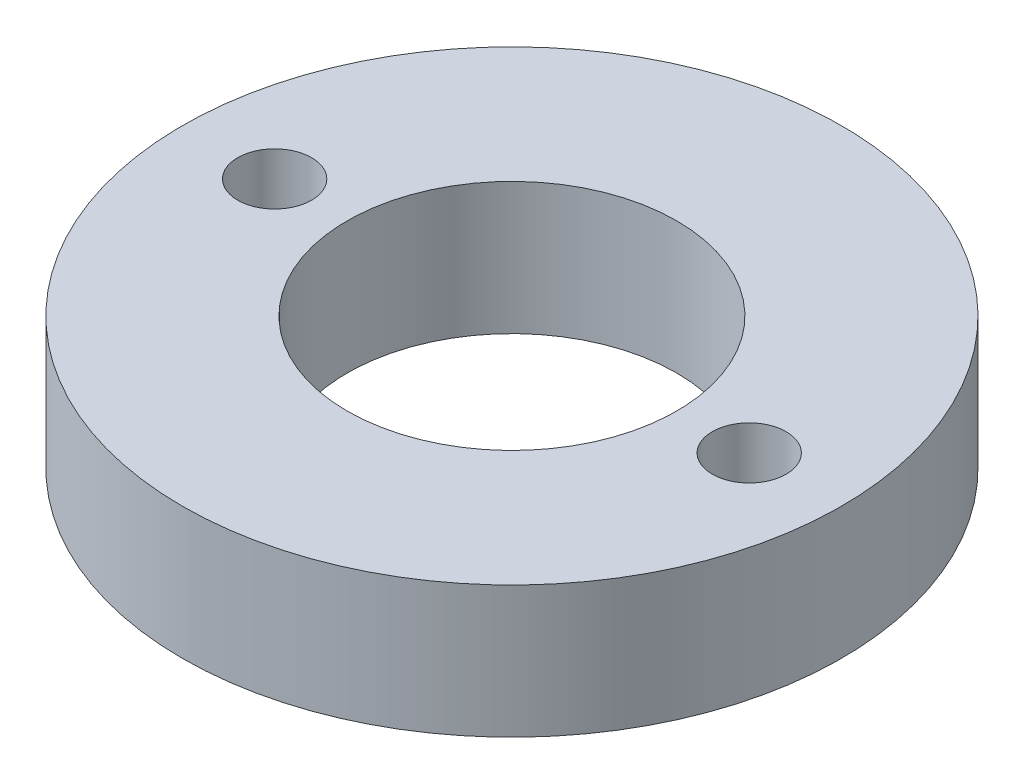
ISO-10303-21;
HEADER;
FILE_DESCRIPTION(('STEP AP214'),'2;1');
FILE_NAME('part.step','',(''),(''),'','','');
FILE_SCHEMA(('AUTOMOTIVE_DESIGN { 1 0 10303 214 1 1 1 1 }'));
ENDSEC;
DATA;
#1=APPLICATION_CONTEXT('core data for automotive mechanical design processes');
#2=APPLICATION_PROTOCOL_DEFINITION('international standard','automotive_design',2000,#1);
#3=PRODUCT_CONTEXT('',#1,'mechanical');
#4=PRODUCT('Part','Part','',(#3));
#5=PRODUCT_RELATED_PRODUCT_CATEGORY('part','',(#4));
#6=PRODUCT_DEFINITION_FORMATION('','',#4);
#7=PRODUCT_DEFINITION_CONTEXT('part definition',#1,'design');
#8=PRODUCT_DEFINITION('design','',#6,#7);
#9=PRODUCT_DEFINITION_SHAPE('','',#8);
#10=(LENGTH_UNIT() NAMED_UNIT(*) SI_UNIT(.MILLI.,.METRE.));
#11=(NAMED_UNIT(*) PLANE_ANGLE_UNIT() SI_UNIT($,.RADIAN.));
#12=(NAMED_UNIT(*) SI_UNIT($,.STERADIAN.) SOLID_ANGLE_UNIT());
#13=UNCERTAINTY_MEASURE_WITH_UNIT(LENGTH_MEASURE(1.E-05),#10,'distance_accuracy_value','');
#14=(GEOMETRIC_REPRESENTATION_CONTEXT(3) GLOBAL_UNCERTAINTY_ASSIGNED_CONTEXT((#13)) GLOBAL_UNIT_ASSIGNED_CONTEXT((#10,
#11,#12)) REPRESENTATION_CONTEXT('',''));
#15=CARTESIAN_POINT('',(0.,0.,0.));
#16=DIRECTION('',(0.,0.,1.));
#17=DIRECTION('',(1.,0.,0.));
#18=AXIS2_PLACEMENT_3D('',#15,#16,#17);
#19=CARTESIAN_POINT('',(0.,6.35,0.));
#20=DIRECTION('',(0.,1.,0.));
#21=DIRECTION('',(0.,0.,1.));
#22=AXIS2_PLACEMENT_3D('',#19,#20,#21);
#23=PLANE('',#22);
#24=CARTESIAN_POINT('',(11.43,6.35,0.));
#25=DIRECTION('',(0.,1.,0.));
#26=DIRECTION('',(0.,0.,1.));
#27=AXIS2_PLACEMENT_3D('',#24,#25,#26);
#28=CIRCLE('',#27,1.778);
#29=CARTESIAN_POINT('',(11.43,6.35,1.778));
#30=VERTEX_POINT('',#29);
#31=EDGE_CURVE('E49',#30,#30,#28,.T.);
#32=ORIENTED_EDGE('',*,*,#31,.F.);
#33=EDGE_LOOP('',(#32));
#34=FACE_BOUND('',#33,.T.);
#35=CARTESIAN_POINT('',(0.,6.35,0.));
#36=DIRECTION('',(0.,1.,0.));
#37=DIRECTION('',(0.,0.,1.));
#38=AXIS2_PLACEMENT_3D('',#35,#36,#37);
#39=CIRCLE('',#38,15.875);
#40=CARTESIAN_POINT('',(0.,6.35,15.875));
#41=VERTEX_POINT('',#40);
#42=EDGE_CURVE('E10',#41,#41,#39,.T.);
#43=ORIENTED_EDGE('',*,*,#42,.T.);
#44=EDGE_LOOP('',(#43));
#45=FACE_BOUND('',#44,.T.);
#46=CARTESIAN_POINT('',(0.,6.35,0.));
#47=DIRECTION('',(0.,1.,0.));
#48=DIRECTION('',(0.,0.,1.));
#49=AXIS2_PLACEMENT_3D('',#46,#47,#48);
#50=CIRCLE('',#49,7.9375);
#51=CARTESIAN_POINT('',(0.,6.35,7.9375));
#52=VERTEX_POINT('',#51);
#53=EDGE_CURVE('E44',#52,#52,#50,.T.);
#54=ORIENTED_EDGE('',*,*,#53,.F.);
#55=EDGE_LOOP('',(#54));
#56=FACE_BOUND('',#55,.T.);
#57=CARTESIAN_POINT('',(-11.43,6.35,0.));
#58=DIRECTION('',(0.,1.,0.));
#59=DIRECTION('',(0.,0.,1.));
#60=AXIS2_PLACEMENT_3D('',#57,#58,#59);
#61=CIRCLE('',#60,1.778);
#62=CARTESIAN_POINT('',(-11.43,6.35,1.778));
#63=VERTEX_POINT('',#62);
#64=EDGE_CURVE('E55',#63,#63,#61,.T.);
#65=ORIENTED_EDGE('',*,*,#64,.F.);
#66=EDGE_LOOP('',(#65));
#67=FACE_BOUND('',#66,.T.);
#68=ADVANCED_FACE('F33',(#34,#45,#56,#67),#23,.T.);
#69=CARTESIAN_POINT('',(0.,0.,0.));
#70=DIRECTION('',(0.,1.,0.));
#71=DIRECTION('',(0.,0.,1.));
#72=AXIS2_PLACEMENT_3D('',#69,#70,#71);
#73=PLANE('',#72);
#74=CARTESIAN_POINT('',(0.,0.,0.));
#75=DIRECTION('',(0.,1.,0.));
#76=DIRECTION('',(0.,0.,1.));
#77=AXIS2_PLACEMENT_3D('',#74,#75,#76);
#78=CIRCLE('',#77,15.875);
#79=CARTESIAN_POINT('',(0.,0.,15.875));
#80=VERTEX_POINT('',#79);
#81=EDGE_CURVE('E37',#80,#80,#78,.T.);
#82=ORIENTED_EDGE('',*,*,#81,.F.);
#83=EDGE_LOOP('',(#82));
#84=FACE_BOUND('',#83,.T.);
#85=CARTESIAN_POINT('',(0.,0.,0.));
#86=DIRECTION('',(0.,1.,0.));
#87=DIRECTION('',(0.,0.,1.));
#88=AXIS2_PLACEMENT_3D('',#85,#86,#87);
#89=CIRCLE('',#88,7.9375);
#90=CARTESIAN_POINT('',(0.,0.,7.9375));
#91=VERTEX_POINT('',#90);
#92=EDGE_CURVE('E46',#91,#91,#89,.T.);
#93=ORIENTED_EDGE('',*,*,#92,.T.);
#94=EDGE_LOOP('',(#93));
#95=FACE_BOUND('',#94,.T.);
#96=CARTESIAN_POINT('',(11.43,0.,0.));
#97=DIRECTION('',(0.,1.,0.));
#98=DIRECTION('',(0.,0.,1.));
#99=AXIS2_PLACEMENT_3D('',#96,#97,#98);
#100=CIRCLE('',#99,1.778);
#101=CARTESIAN_POINT('',(11.43,0.,1.778));
#102=VERTEX_POINT('',#101);
#103=EDGE_CURVE('E52',#102,#102,#100,.T.);
#104=ORIENTED_EDGE('',*,*,#103,.T.);
#105=EDGE_LOOP('',(#104));
#106=FACE_BOUND('',#105,.T.);
#107=CARTESIAN_POINT('',(-11.43,0.,0.));
#108=DIRECTION('',(0.,1.,0.));
#109=DIRECTION('',(0.,0.,1.));
#110=AXIS2_PLACEMENT_3D('',#107,#108,#109);
#111=CIRCLE('',#110,1.778);
#112=CARTESIAN_POINT('',(-11.43,0.,1.778));
#113=VERTEX_POINT('',#112);
#114=EDGE_CURVE('E58',#113,#113,#111,.T.);
#115=ORIENTED_EDGE('',*,*,#114,.T.);
#116=EDGE_LOOP('',(#115));
#117=FACE_BOUND('',#116,.T.);
#118=ADVANCED_FACE('F68',(#84,#95,#106,#117),#73,.F.);
#119=CARTESIAN_POINT('',(0.,6.35,0.));
#120=DIRECTION('',(0.,-1.,0.));
#121=DIRECTION('',(0.,0.,-1.));
#122=AXIS2_PLACEMENT_3D('',#119,#120,#121);
#123=CYLINDRICAL_SURFACE('',#122,15.875);
#124=ORIENTED_EDGE('',*,*,#42,.F.);
#125=EDGE_LOOP('',(#124));
#126=FACE_BOUND('',#125,.T.);
#127=ORIENTED_EDGE('',*,*,#81,.T.);
#128=EDGE_LOOP('',(#127));
#129=FACE_BOUND('',#128,.T.);
#130=ADVANCED_FACE('F35',(#126,#129),#123,.T.);
#131=CARTESIAN_POINT('',(0.,6.35,0.));
#132=DIRECTION('',(0.,-1.,0.));
#133=DIRECTION('',(0.,0.,-1.));
#134=AXIS2_PLACEMENT_3D('',#131,#132,#133);
#135=CYLINDRICAL_SURFACE('',#134,7.9375);
#136=ORIENTED_EDGE('',*,*,#53,.T.);
#137=EDGE_LOOP('',(#136));
#138=FACE_BOUND('',#137,.T.);
#139=ORIENTED_EDGE('',*,*,#92,.F.);
#140=EDGE_LOOP('',(#139));
#141=FACE_BOUND('',#140,.T.);
#142=ADVANCED_FACE('F77',(#138,#141),#135,.F.);
#143=CARTESIAN_POINT('',(11.43,6.35,0.));
#144=DIRECTION('',(0.,-1.,0.));
#145=DIRECTION('',(0.,0.,-1.));
#146=AXIS2_PLACEMENT_3D('',#143,#144,#145);
#147=CYLINDRICAL_SURFACE('',#146,1.778);
#148=ORIENTED_EDGE('',*,*,#31,.T.);
#149=EDGE_LOOP('',(#148));
#150=FACE_BOUND('',#149,.T.);
#151=ORIENTED_EDGE('',*,*,#103,.F.);
#152=EDGE_LOOP('',(#151));
#153=FACE_BOUND('',#152,.T.);
#154=ADVANCED_FACE('F80',(#150,#153),#147,.F.);
#155=CARTESIAN_POINT('',(-11.43,6.35,0.));
#156=DIRECTION('',(0.,-1.,0.));
#157=DIRECTION('',(0.,0.,-1.));
#158=AXIS2_PLACEMENT_3D('',#155,#156,#157);
#159=CYLINDRICAL_SURFACE('',#158,1.778);
#160=ORIENTED_EDGE('',*,*,#64,.T.);
#161=EDGE_LOOP('',(#160));
#162=FACE_BOUND('',#161,.T.);
#163=ORIENTED_EDGE('',*,*,#114,.F.);
#164=EDGE_LOOP('',(#163));
#165=FACE_BOUND('',#164,.T.);
#166=ADVANCED_FACE('F64',(#162,#165),#159,.F.);
#167=CLOSED_SHELL('',(#68,#118,#130,#142,#154,#166));
#168=MANIFOLD_SOLID_BREP('B2',#167);
#169=ADVANCED_BREP_SHAPE_REPRESENTATION('',(#18,#168),#14);
#170=SHAPE_DEFINITION_REPRESENTATION(#9,#169);
ENDSEC;
END-ISO-10303-21;
